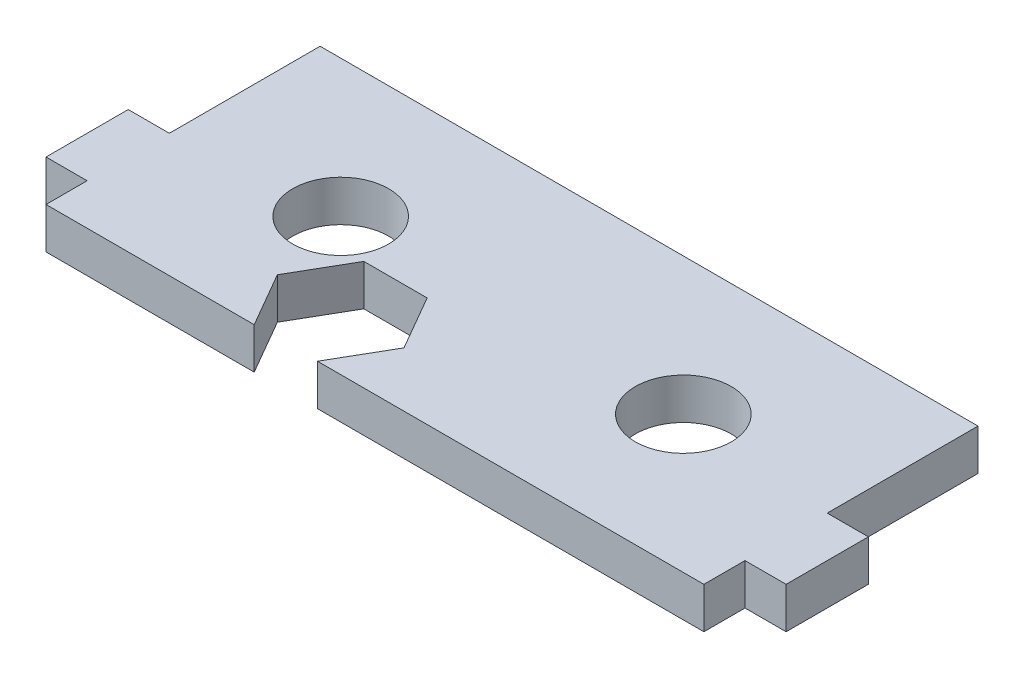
from build123d import *

# Parameters (mm, degrees)
SKETCH1_W           = 48
SKETCH1_H           = 20
BOSS_EXTRUDE1_DEPTH = 3
SKETCH2_W           = 3
SKETCH2_H           = 6
BOSS_EXTRUDE2_DEPTH = 3
SKETCH3_R           = 3.5
CUT_EXTRUDE1_DEPTH  = 3


with BuildPart() as part:
    # Sketch1 → Boss-Extrude1 (new body)
    with BuildSketch(Plane(origin=(0, 0, 0), x_dir=(1, 0, 0), z_dir=(0, 1, 0))):
        Rectangle(SKETCH1_W, SKETCH1_H)
    extrude(amount=BOSS_EXTRUDE1_DEPTH)

    # Sketch2 → Boss-Extrude2 (add)
    with BuildSketch(Plane(origin=(0, 0, 0), x_dir=(1, 0, 0), z_dir=(0, 1, 0))):
        with Locations((-25.5, -4)):
            Rectangle(SKETCH2_W, SKETCH2_H)
        with Locations((25.5, -4)):
            Rectangle(SKETCH2_W, SKETCH2_H)
    extrude(amount=BOSS_EXTRUDE2_DEPTH)

    # Sketch3 → Cut-Extrude1 (cut)
    with BuildSketch(Plane(origin=(0, 0, 0), x_dir=(1, 0, 0), z_dir=(0, 1, 0))):
        with Locations(Location((-12.5, 0, 0), (0, 0, 270))):
            Circle(SKETCH3_R)
        with Locations(Location((12.5, 0, 0), (0, 0, 270))):
            Circle(SKETCH3_R)
        Polygon((-4.190598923, -2), (-8.809401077, -2), (-11.118802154, -6), (-8.809401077, -10), (-4.190598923, -10), (-1.881197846, -6), align=None)
    extrude(amount=CUT_EXTRUDE1_DEPTH, mode=Mode.SUBTRACT)


solid = part.part
